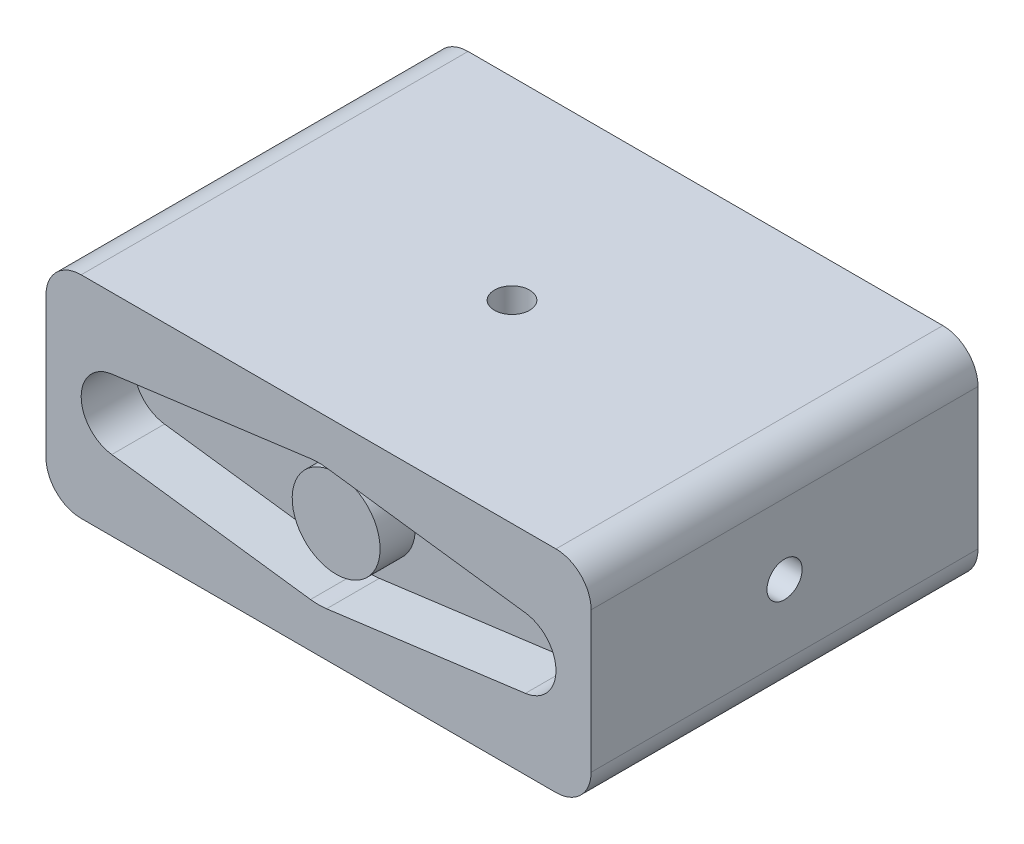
ISO-10303-21;
HEADER;
FILE_DESCRIPTION(('STEP AP214'),'2;1');
FILE_NAME('part.step','',(''),(''),'','','');
FILE_SCHEMA(('AUTOMOTIVE_DESIGN { 1 0 10303 214 1 1 1 1 }'));
ENDSEC;
DATA;
#1=APPLICATION_CONTEXT('core data for automotive mechanical design processes');
#2=APPLICATION_PROTOCOL_DEFINITION('international standard','automotive_design',2000,#1);
#3=PRODUCT_CONTEXT('',#1,'mechanical');
#4=PRODUCT('Part','Part','',(#3));
#5=PRODUCT_RELATED_PRODUCT_CATEGORY('part','',(#4));
#6=PRODUCT_DEFINITION_FORMATION('','',#4);
#7=PRODUCT_DEFINITION_CONTEXT('part definition',#1,'design');
#8=PRODUCT_DEFINITION('design','',#6,#7);
#9=PRODUCT_DEFINITION_SHAPE('','',#8);
#10=(LENGTH_UNIT() NAMED_UNIT(*) SI_UNIT(.MILLI.,.METRE.));
#11=(NAMED_UNIT(*) PLANE_ANGLE_UNIT() SI_UNIT($,.RADIAN.));
#12=(NAMED_UNIT(*) SI_UNIT($,.STERADIAN.) SOLID_ANGLE_UNIT());
#13=UNCERTAINTY_MEASURE_WITH_UNIT(LENGTH_MEASURE(1.E-05),#10,'distance_accuracy_value','');
#14=(GEOMETRIC_REPRESENTATION_CONTEXT(3) GLOBAL_UNCERTAINTY_ASSIGNED_CONTEXT((#13)) GLOBAL_UNIT_ASSIGNED_CONTEXT((#10,
#11,#12)) REPRESENTATION_CONTEXT('',''));
#15=CARTESIAN_POINT('',(0.,0.,0.));
#16=DIRECTION('',(0.,0.,1.));
#17=DIRECTION('',(1.,0.,0.));
#18=AXIS2_PLACEMENT_3D('',#15,#16,#17);
#19=CARTESIAN_POINT('',(0.,0.,0.));
#20=DIRECTION('',(0.,0.,1.));
#21=DIRECTION('',(1.,0.,0.));
#22=AXIS2_PLACEMENT_3D('',#19,#20,#21);
#23=PLANE('',#22);
#24=DIRECTION('',(0.991456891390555,0.130434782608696,0.));
#25=VECTOR('',#24,1.);
#26=CARTESIAN_POINT('',(-5.95652173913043,3.47009911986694,0.));
#27=LINE('',#26,#25);
#28=CARTESIAN_POINT('',(-17.2608695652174,1.98291378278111,0.));
#29=VERTEX_POINT('',#28);
#30=CARTESIAN_POINT('',(-5.95652173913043,3.47009911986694,0.));
#31=VERTEX_POINT('',#30);
#32=EDGE_CURVE('E387',#29,#31,#27,.T.);
#33=ORIENTED_EDGE('',*,*,#32,.T.);
#34=CARTESIAN_POINT('',(-5.5,0.,0.));
#35=DIRECTION('',(0.,0.,1.));
#36=DIRECTION('',(1.,0.,0.));
#37=AXIS2_PLACEMENT_3D('',#34,#35,#36);
#38=CIRCLE('',#37,3.5);
#39=CARTESIAN_POINT('',(-5.04347826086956,3.47009911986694,0.));
#40=VERTEX_POINT('',#39);
#41=EDGE_CURVE('E374',#31,#40,#38,.F.);
#42=ORIENTED_EDGE('',*,*,#41,.T.);
#43=DIRECTION('',(0.991456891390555,-0.130434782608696,0.));
#44=VECTOR('',#43,1.);
#45=CARTESIAN_POINT('',(-5.04347826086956,3.47009911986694,0.));
#46=LINE('',#45,#44);
#47=CARTESIAN_POINT('',(6.26086956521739,1.98291378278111,0.));
#48=VERTEX_POINT('',#47);
#49=EDGE_CURVE('E384',#40,#48,#46,.T.);
#50=ORIENTED_EDGE('',*,*,#49,.T.);
#51=CARTESIAN_POINT('',(6.,0.,0.));
#52=DIRECTION('',(0.,0.,-1.));
#53=DIRECTION('',(0.,1.,0.));
#54=AXIS2_PLACEMENT_3D('',#51,#52,#53);
#55=CIRCLE('',#54,2.);
#56=CARTESIAN_POINT('',(6.26086956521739,-1.98291378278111,0.));
#57=VERTEX_POINT('',#56);
#58=EDGE_CURVE('E509',#48,#57,#55,.T.);
#59=ORIENTED_EDGE('',*,*,#58,.T.);
#60=DIRECTION('',(-0.991456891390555,-0.130434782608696,0.));
#61=VECTOR('',#60,1.);
#62=CARTESIAN_POINT('',(-5.04347826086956,-3.47009911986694,0.));
#63=LINE('',#62,#61);
#64=CARTESIAN_POINT('',(-5.04347826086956,-3.47009911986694,0.));
#65=VERTEX_POINT('',#64);
#66=EDGE_CURVE('E507',#57,#65,#63,.T.);
#67=ORIENTED_EDGE('',*,*,#66,.T.);
#68=CARTESIAN_POINT('',(-5.95652173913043,-3.47009911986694,0.));
#69=VERTEX_POINT('',#68);
#70=EDGE_CURVE('E44',#65,#69,#38,.F.);
#71=ORIENTED_EDGE('',*,*,#70,.T.);
#72=DIRECTION('',(-0.991456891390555,0.130434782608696,0.));
#73=VECTOR('',#72,1.);
#74=CARTESIAN_POINT('',(-5.95652173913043,-3.47009911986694,0.));
#75=LINE('',#74,#73);
#76=CARTESIAN_POINT('',(-17.2608695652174,-1.98291378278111,0.));
#77=VERTEX_POINT('',#76);
#78=EDGE_CURVE('E490',#69,#77,#75,.T.);
#79=ORIENTED_EDGE('',*,*,#78,.T.);
#80=CARTESIAN_POINT('',(-17.,0.,0.));
#81=DIRECTION('',(0.,0.,-1.));
#82=DIRECTION('',(0.,-1.,0.));
#83=AXIS2_PLACEMENT_3D('',#80,#81,#82);
#84=CIRCLE('',#83,2.);
#85=EDGE_CURVE('E492',#77,#29,#84,.T.);
#86=ORIENTED_EDGE('',*,*,#85,.T.);
#87=EDGE_LOOP('',(#33,#42,#50,#59,#67,#71,#79,#86));
#88=FACE_BOUND('',#87,.T.);
#89=DIRECTION('',(0.,1.,0.));
#90=VECTOR('',#89,1.);
#91=CARTESIAN_POINT('',(10.,-6.,0.));
#92=LINE('',#91,#90);
#93=CARTESIAN_POINT('',(10.,-4.,0.));
#94=VERTEX_POINT('',#93);
#95=CARTESIAN_POINT('',(10.,4.,0.));
#96=VERTEX_POINT('',#95);
#97=EDGE_CURVE('E417',#94,#96,#92,.T.);
#98=ORIENTED_EDGE('',*,*,#97,.T.);
#99=CARTESIAN_POINT('',(8.,4.,0.));
#100=DIRECTION('',(0.,0.,1.));
#101=DIRECTION('',(1.,0.,0.));
#102=AXIS2_PLACEMENT_3D('',#99,#100,#101);
#103=CIRCLE('',#102,2.);
#104=CARTESIAN_POINT('',(8.,6.,0.));
#105=VERTEX_POINT('',#104);
#106=EDGE_CURVE('E450',#96,#105,#103,.T.);
#107=ORIENTED_EDGE('',*,*,#106,.T.);
#108=DIRECTION('',(-1.,0.,0.));
#109=VECTOR('',#108,1.);
#110=CARTESIAN_POINT('',(10.,6.,0.));
#111=LINE('',#110,#109);
#112=CARTESIAN_POINT('',(-19.,6.,0.));
#113=VERTEX_POINT('',#112);
#114=EDGE_CURVE('E432',#105,#113,#111,.T.);
#115=ORIENTED_EDGE('',*,*,#114,.T.);
#116=CARTESIAN_POINT('',(-19.,4.,0.));
#117=DIRECTION('',(0.,0.,1.));
#118=DIRECTION('',(1.,0.,0.));
#119=AXIS2_PLACEMENT_3D('',#116,#117,#118);
#120=CIRCLE('',#119,2.);
#121=CARTESIAN_POINT('',(-21.,4.,0.));
#122=VERTEX_POINT('',#121);
#123=EDGE_CURVE('E448',#113,#122,#120,.T.);
#124=ORIENTED_EDGE('',*,*,#123,.T.);
#125=DIRECTION('',(0.,-1.,0.));
#126=VECTOR('',#125,1.);
#127=CARTESIAN_POINT('',(-21.,-6.,0.));
#128=LINE('',#127,#126);
#129=CARTESIAN_POINT('',(-21.,-4.,0.));
#130=VERTEX_POINT('',#129);
#131=EDGE_CURVE('E435',#122,#130,#128,.T.);
#132=ORIENTED_EDGE('',*,*,#131,.T.);
#133=CARTESIAN_POINT('',(-19.,-4.,0.));
#134=DIRECTION('',(0.,0.,1.));
#135=DIRECTION('',(1.,0.,0.));
#136=AXIS2_PLACEMENT_3D('',#133,#134,#135);
#137=CIRCLE('',#136,2.);
#138=CARTESIAN_POINT('',(-19.,-6.,0.));
#139=VERTEX_POINT('',#138);
#140=EDGE_CURVE('E444',#130,#139,#137,.T.);
#141=ORIENTED_EDGE('',*,*,#140,.T.);
#142=DIRECTION('',(1.,0.,0.));
#143=VECTOR('',#142,1.);
#144=CARTESIAN_POINT('',(10.,-6.,0.));
#145=LINE('',#144,#143);
#146=CARTESIAN_POINT('',(8.,-6.,0.));
#147=VERTEX_POINT('',#146);
#148=EDGE_CURVE('E422',#139,#147,#145,.T.);
#149=ORIENTED_EDGE('',*,*,#148,.T.);
#150=CARTESIAN_POINT('',(8.,-4.,0.));
#151=DIRECTION('',(0.,0.,1.));
#152=DIRECTION('',(1.,0.,0.));
#153=AXIS2_PLACEMENT_3D('',#150,#151,#152);
#154=CIRCLE('',#153,2.);
#155=EDGE_CURVE('E446',#147,#94,#154,.T.);
#156=ORIENTED_EDGE('',*,*,#155,.T.);
#157=EDGE_LOOP('',(#98,#107,#115,#124,#132,#141,#149,#156));
#158=FACE_BOUND('',#157,.T.);
#159=ADVANCED_FACE('F35',(#88,#158),#23,.T.);
#160=CARTESIAN_POINT('',(10.,-6.,-22.));
#161=DIRECTION('',(1.,0.,0.));
#162=DIRECTION('',(0.,0.,-1.));
#163=AXIS2_PLACEMENT_3D('',#160,#161,#162);
#164=PLANE('',#163);
#165=CARTESIAN_POINT('',(10.,0.,-11.));
#166=DIRECTION('',(1.,0.,0.));
#167=DIRECTION('',(0.,0.,-1.));
#168=AXIS2_PLACEMENT_3D('',#165,#166,#167);
#169=CIRCLE('',#168,1.);
#170=CARTESIAN_POINT('',(10.,0.,-12.));
#171=VERTEX_POINT('',#170);
#172=EDGE_CURVE('E809',#171,#171,#169,.F.);
#173=ORIENTED_EDGE('',*,*,#172,.T.);
#174=EDGE_LOOP('',(#173));
#175=FACE_BOUND('',#174,.T.);
#176=DIRECTION('',(0.,1.,0.));
#177=VECTOR('',#176,1.);
#178=CARTESIAN_POINT('',(10.,-6.,-22.));
#179=LINE('',#178,#177);
#180=CARTESIAN_POINT('',(10.,-4.,-22.));
#181=VERTEX_POINT('',#180);
#182=CARTESIAN_POINT('',(10.,4.,-22.));
#183=VERTEX_POINT('',#182);
#184=EDGE_CURVE('E418',#181,#183,#179,.T.);
#185=ORIENTED_EDGE('',*,*,#184,.T.);
#186=DIRECTION('',(0.,0.,1.));
#187=VECTOR('',#186,1.);
#188=CARTESIAN_POINT('',(10.,4.,-22.));
#189=LINE('',#188,#187);
#190=EDGE_CURVE('E441',#183,#96,#189,.T.);
#191=ORIENTED_EDGE('',*,*,#190,.T.);
#192=ORIENTED_EDGE('',*,*,#97,.F.);
#193=DIRECTION('',(0.,0.,1.));
#194=VECTOR('',#193,1.);
#195=CARTESIAN_POINT('',(10.,-4.,-22.));
#196=LINE('',#195,#194);
#197=EDGE_CURVE('E349',#94,#181,#196,.F.);
#198=ORIENTED_EDGE('',*,*,#197,.T.);
#199=EDGE_LOOP('',(#185,#191,#192,#198));
#200=FACE_BOUND('',#199,.T.);
#201=ADVANCED_FACE('F316',(#175,#200),#164,.T.);
#202=CARTESIAN_POINT('',(10.,-6.,-22.));
#203=DIRECTION('',(0.,-1.,0.));
#204=DIRECTION('',(1.,0.,0.));
#205=AXIS2_PLACEMENT_3D('',#202,#203,#204);
#206=PLANE('',#205);
#207=DIRECTION('',(1.,0.,0.));
#208=VECTOR('',#207,1.);
#209=CARTESIAN_POINT('',(10.,-6.,-22.));
#210=LINE('',#209,#208);
#211=CARTESIAN_POINT('',(-19.,-6.,-22.));
#212=VERTEX_POINT('',#211);
#213=CARTESIAN_POINT('',(8.,-6.,-22.));
#214=VERTEX_POINT('',#213);
#215=EDGE_CURVE('E428',#212,#214,#210,.T.);
#216=ORIENTED_EDGE('',*,*,#215,.T.);
#217=DIRECTION('',(0.,0.,1.));
#218=VECTOR('',#217,1.);
#219=CARTESIAN_POINT('',(8.,-6.,-22.));
#220=LINE('',#219,#218);
#221=EDGE_CURVE('E351',#214,#147,#220,.T.);
#222=ORIENTED_EDGE('',*,*,#221,.T.);
#223=ORIENTED_EDGE('',*,*,#148,.F.);
#224=DIRECTION('',(0.,0.,1.));
#225=VECTOR('',#224,1.);
#226=CARTESIAN_POINT('',(-19.,-6.,-22.));
#227=LINE('',#226,#225);
#228=EDGE_CURVE('E371',#139,#212,#227,.F.);
#229=ORIENTED_EDGE('',*,*,#228,.T.);
#230=EDGE_LOOP('',(#216,#222,#223,#229));
#231=FACE_BOUND('',#230,.T.);
#232=ADVANCED_FACE('F318',(#231),#206,.T.);
#233=CARTESIAN_POINT('',(-21.,-6.,-22.));
#234=DIRECTION('',(-1.,0.,0.));
#235=DIRECTION('',(0.,0.,1.));
#236=AXIS2_PLACEMENT_3D('',#233,#234,#235);
#237=PLANE('',#236);
#238=CARTESIAN_POINT('',(-21.,0.,-11.));
#239=DIRECTION('',(-1.,0.,0.));
#240=DIRECTION('',(0.,0.,1.));
#241=AXIS2_PLACEMENT_3D('',#238,#239,#240);
#242=CIRCLE('',#241,1.);
#243=CARTESIAN_POINT('',(-21.,0.,-10.));
#244=VERTEX_POINT('',#243);
#245=EDGE_CURVE('E801',#244,#244,#242,.T.);
#246=ORIENTED_EDGE('',*,*,#245,.F.);
#247=EDGE_LOOP('',(#246));
#248=FACE_BOUND('',#247,.T.);
#249=ORIENTED_EDGE('',*,*,#131,.F.);
#250=DIRECTION('',(0.,0.,1.));
#251=VECTOR('',#250,1.);
#252=CARTESIAN_POINT('',(-21.,4.,-22.));
#253=LINE('',#252,#251);
#254=CARTESIAN_POINT('',(-21.,4.,-22.));
#255=VERTEX_POINT('',#254);
#256=EDGE_CURVE('E369',#122,#255,#253,.F.);
#257=ORIENTED_EDGE('',*,*,#256,.T.);
#258=DIRECTION('',(0.,-1.,0.));
#259=VECTOR('',#258,1.);
#260=CARTESIAN_POINT('',(-21.,-6.,-22.));
#261=LINE('',#260,#259);
#262=CARTESIAN_POINT('',(-21.,-4.,-22.));
#263=VERTEX_POINT('',#262);
#264=EDGE_CURVE('E425',#255,#263,#261,.T.);
#265=ORIENTED_EDGE('',*,*,#264,.T.);
#266=DIRECTION('',(0.,0.,1.));
#267=VECTOR('',#266,1.);
#268=CARTESIAN_POINT('',(-21.,-4.,-22.));
#269=LINE('',#268,#267);
#270=EDGE_CURVE('E366',#263,#130,#269,.T.);
#271=ORIENTED_EDGE('',*,*,#270,.T.);
#272=EDGE_LOOP('',(#249,#257,#265,#271));
#273=FACE_BOUND('',#272,.T.);
#274=ADVANCED_FACE('F321',(#248,#273),#237,.T.);
#275=CARTESIAN_POINT('',(10.,6.,-22.));
#276=DIRECTION('',(0.,1.,0.));
#277=DIRECTION('',(-1.,0.,0.));
#278=AXIS2_PLACEMENT_3D('',#275,#276,#277);
#279=PLANE('',#278);
#280=CARTESIAN_POINT('',(-5.5,6.,-11.));
#281=DIRECTION('',(0.,1.,0.));
#282=DIRECTION('',(-1.,0.,0.));
#283=AXIS2_PLACEMENT_3D('',#280,#281,#282);
#284=CIRCLE('',#283,1.);
#285=CARTESIAN_POINT('',(-6.5,6.,-11.));
#286=VERTEX_POINT('',#285);
#287=EDGE_CURVE('E805',#286,#286,#284,.T.);
#288=ORIENTED_EDGE('',*,*,#287,.F.);
#289=EDGE_LOOP('',(#288));
#290=FACE_BOUND('',#289,.T.);
#291=ORIENTED_EDGE('',*,*,#114,.F.);
#292=DIRECTION('',(0.,0.,1.));
#293=VECTOR('',#292,1.);
#294=CARTESIAN_POINT('',(8.,6.,-22.));
#295=LINE('',#294,#293);
#296=CARTESIAN_POINT('',(8.,6.,-22.));
#297=VERTEX_POINT('',#296);
#298=EDGE_CURVE('E361',#105,#297,#295,.F.);
#299=ORIENTED_EDGE('',*,*,#298,.T.);
#300=DIRECTION('',(-1.,0.,0.));
#301=VECTOR('',#300,1.);
#302=CARTESIAN_POINT('',(10.,6.,-22.));
#303=LINE('',#302,#301);
#304=CARTESIAN_POINT('',(-19.,6.,-22.));
#305=VERTEX_POINT('',#304);
#306=EDGE_CURVE('E421',#297,#305,#303,.T.);
#307=ORIENTED_EDGE('',*,*,#306,.T.);
#308=DIRECTION('',(0.,0.,1.));
#309=VECTOR('',#308,1.);
#310=CARTESIAN_POINT('',(-19.,6.,-22.));
#311=LINE('',#310,#309);
#312=EDGE_CURVE('E452',#305,#113,#311,.T.);
#313=ORIENTED_EDGE('',*,*,#312,.T.);
#314=EDGE_LOOP('',(#291,#299,#307,#313));
#315=FACE_BOUND('',#314,.T.);
#316=ADVANCED_FACE('F312',(#290,#315),#279,.T.);
#317=CARTESIAN_POINT('',(0.,0.,-22.));
#318=DIRECTION('',(0.,0.,1.));
#319=DIRECTION('',(1.,0.,0.));
#320=AXIS2_PLACEMENT_3D('',#317,#318,#319);
#321=PLANE('',#320);
#322=DIRECTION('',(1.,0.,0.));
#323=VECTOR('',#322,1.);
#324=CARTESIAN_POINT('',(-17.,4.00000000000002,-22.));
#325=LINE('',#324,#323);
#326=CARTESIAN_POINT('',(-17.,4.00000000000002,-22.));
#327=VERTEX_POINT('',#326);
#328=CARTESIAN_POINT('',(6.00000000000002,4.00000000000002,-22.));
#329=VERTEX_POINT('',#328);
#330=EDGE_CURVE('E228',#327,#329,#325,.T.);
#331=ORIENTED_EDGE('',*,*,#330,.F.);
#332=DIRECTION('',(0.,1.,0.));
#333=VECTOR('',#332,1.);
#334=CARTESIAN_POINT('',(-17.,4.00000000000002,-22.));
#335=LINE('',#334,#333);
#336=CARTESIAN_POINT('',(-17.,-3.99999999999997,-22.));
#337=VERTEX_POINT('',#336);
#338=EDGE_CURVE('E51',#337,#327,#335,.T.);
#339=ORIENTED_EDGE('',*,*,#338,.F.);
#340=DIRECTION('',(-1.,0.,0.));
#341=VECTOR('',#340,1.);
#342=CARTESIAN_POINT('',(-17.,-3.99999999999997,-22.));
#343=LINE('',#342,#341);
#344=CARTESIAN_POINT('',(6.00000000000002,-3.99999999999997,-22.));
#345=VERTEX_POINT('',#344);
#346=EDGE_CURVE('E216',#345,#337,#343,.T.);
#347=ORIENTED_EDGE('',*,*,#346,.F.);
#348=DIRECTION('',(0.,-1.,0.));
#349=VECTOR('',#348,1.);
#350=CARTESIAN_POINT('',(6.00000000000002,4.00000000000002,-22.));
#351=LINE('',#350,#349);
#352=EDGE_CURVE('E219',#329,#345,#351,.T.);
#353=ORIENTED_EDGE('',*,*,#352,.F.);
#354=EDGE_LOOP('',(#331,#339,#347,#353));
#355=FACE_BOUND('',#354,.T.);
#356=ORIENTED_EDGE('',*,*,#306,.F.);
#357=CARTESIAN_POINT('',(8.,4.,-22.));
#358=DIRECTION('',(0.,0.,1.));
#359=DIRECTION('',(1.,0.,0.));
#360=AXIS2_PLACEMENT_3D('',#357,#358,#359);
#361=CIRCLE('',#360,2.);
#362=EDGE_CURVE('E359',#297,#183,#361,.F.);
#363=ORIENTED_EDGE('',*,*,#362,.T.);
#364=ORIENTED_EDGE('',*,*,#184,.F.);
#365=CARTESIAN_POINT('',(8.,-4.,-22.));
#366=DIRECTION('',(0.,0.,1.));
#367=DIRECTION('',(1.,0.,0.));
#368=AXIS2_PLACEMENT_3D('',#365,#366,#367);
#369=CIRCLE('',#368,2.);
#370=EDGE_CURVE('E348',#181,#214,#369,.F.);
#371=ORIENTED_EDGE('',*,*,#370,.T.);
#372=ORIENTED_EDGE('',*,*,#215,.F.);
#373=CARTESIAN_POINT('',(-19.,-4.,-22.));
#374=DIRECTION('',(0.,0.,1.));
#375=DIRECTION('',(1.,0.,0.));
#376=AXIS2_PLACEMENT_3D('',#373,#374,#375);
#377=CIRCLE('',#376,2.);
#378=EDGE_CURVE('E357',#212,#263,#377,.F.);
#379=ORIENTED_EDGE('',*,*,#378,.T.);
#380=ORIENTED_EDGE('',*,*,#264,.F.);
#381=CARTESIAN_POINT('',(-19.,4.,-22.));
#382=DIRECTION('',(0.,0.,1.));
#383=DIRECTION('',(1.,0.,0.));
#384=AXIS2_PLACEMENT_3D('',#381,#382,#383);
#385=CIRCLE('',#384,2.);
#386=EDGE_CURVE('E356',#255,#305,#385,.F.);
#387=ORIENTED_EDGE('',*,*,#386,.T.);
#388=EDGE_LOOP('',(#356,#363,#364,#371,#372,#379,#380,#387));
#389=FACE_BOUND('',#388,.T.);
#390=ADVANCED_FACE('F308',(#355,#389),#321,.F.);
#391=CARTESIAN_POINT('',(8.,4.,-22.));
#392=DIRECTION('',(0.,0.,1.));
#393=DIRECTION('',(1.,0.,0.));
#394=AXIS2_PLACEMENT_3D('',#391,#392,#393);
#395=CYLINDRICAL_SURFACE('',#394,2.);
#396=ORIENTED_EDGE('',*,*,#362,.F.);
#397=ORIENTED_EDGE('',*,*,#298,.F.);
#398=ORIENTED_EDGE('',*,*,#106,.F.);
#399=ORIENTED_EDGE('',*,*,#190,.F.);
#400=EDGE_LOOP('',(#396,#397,#398,#399));
#401=FACE_BOUND('',#400,.T.);
#402=ADVANCED_FACE('F311',(#401),#395,.T.);
#403=CARTESIAN_POINT('',(-19.,4.,-22.));
#404=DIRECTION('',(0.,0.,1.));
#405=DIRECTION('',(1.,0.,0.));
#406=AXIS2_PLACEMENT_3D('',#403,#404,#405);
#407=CYLINDRICAL_SURFACE('',#406,2.);
#408=ORIENTED_EDGE('',*,*,#386,.F.);
#409=ORIENTED_EDGE('',*,*,#256,.F.);
#410=ORIENTED_EDGE('',*,*,#123,.F.);
#411=ORIENTED_EDGE('',*,*,#312,.F.);
#412=EDGE_LOOP('',(#408,#409,#410,#411));
#413=FACE_BOUND('',#412,.T.);
#414=ADVANCED_FACE('F334',(#413),#407,.T.);
#415=CARTESIAN_POINT('',(8.,-4.,-22.));
#416=DIRECTION('',(0.,0.,1.));
#417=DIRECTION('',(1.,0.,0.));
#418=AXIS2_PLACEMENT_3D('',#415,#416,#417);
#419=CYLINDRICAL_SURFACE('',#418,2.);
#420=ORIENTED_EDGE('',*,*,#370,.F.);
#421=ORIENTED_EDGE('',*,*,#197,.F.);
#422=ORIENTED_EDGE('',*,*,#155,.F.);
#423=ORIENTED_EDGE('',*,*,#221,.F.);
#424=EDGE_LOOP('',(#420,#421,#422,#423));
#425=FACE_BOUND('',#424,.T.);
#426=ADVANCED_FACE('F337',(#425),#419,.T.);
#427=CARTESIAN_POINT('',(-19.,-4.,-22.));
#428=DIRECTION('',(0.,0.,1.));
#429=DIRECTION('',(1.,0.,0.));
#430=AXIS2_PLACEMENT_3D('',#427,#428,#429);
#431=CYLINDRICAL_SURFACE('',#430,2.);
#432=ORIENTED_EDGE('',*,*,#378,.F.);
#433=ORIENTED_EDGE('',*,*,#228,.F.);
#434=ORIENTED_EDGE('',*,*,#140,.F.);
#435=ORIENTED_EDGE('',*,*,#270,.F.);
#436=EDGE_LOOP('',(#432,#433,#434,#435));
#437=FACE_BOUND('',#436,.T.);
#438=ADVANCED_FACE('F37',(#437),#431,.T.);
#439=CARTESIAN_POINT('',(-5.5,0.,-3.00000000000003));
#440=DIRECTION('',(0.,0.,1.));
#441=DIRECTION('',(0.,1.,0.));
#442=AXIS2_PLACEMENT_3D('',#439,#440,#441);
#443=CYLINDRICAL_SURFACE('',#442,3.5);
#444=DIRECTION('',(0.,0.,-1.));
#445=VECTOR('',#444,1.);
#446=CARTESIAN_POINT('',(-5.04347826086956,-3.47009911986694,0.));
#447=LINE('',#446,#445);
#448=CARTESIAN_POINT('',(-5.04347826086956,-3.47009911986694,-3.00000000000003));
#449=VERTEX_POINT('',#448);
#450=EDGE_CURVE('E482',#65,#449,#447,.T.);
#451=ORIENTED_EDGE('',*,*,#450,.T.);
#452=CARTESIAN_POINT('',(-5.5,0.,-3.00000000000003));
#453=DIRECTION('',(0.,0.,-1.));
#454=DIRECTION('',(0.,-1.,0.));
#455=AXIS2_PLACEMENT_3D('',#452,#453,#454);
#456=CIRCLE('',#455,3.5);
#457=CARTESIAN_POINT('',(-5.95652173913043,-3.47009911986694,-3.00000000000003));
#458=VERTEX_POINT('',#457);
#459=EDGE_CURVE('E401',#449,#458,#456,.T.);
#460=ORIENTED_EDGE('',*,*,#459,.T.);
#461=DIRECTION('',(0.,0.,-1.));
#462=VECTOR('',#461,1.);
#463=CARTESIAN_POINT('',(-5.95652173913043,-3.47009911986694,0.));
#464=LINE('',#463,#462);
#465=EDGE_CURVE('E409',#69,#458,#464,.T.);
#466=ORIENTED_EDGE('',*,*,#465,.F.);
#467=ORIENTED_EDGE('',*,*,#70,.F.);
#468=EDGE_LOOP('',(#451,#460,#466,#467));
#469=FACE_BOUND('',#468,.T.);
#470=ADVANCED_FACE('F300',(#469),#443,.F.);
#471=CARTESIAN_POINT('',(-5.5,0.,-3.00000000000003));
#472=DIRECTION('',(0.,0.,-1.));
#473=DIRECTION('',(0.,-1.,0.));
#474=AXIS2_PLACEMENT_3D('',#471,#472,#473);
#475=PLANE('',#474);
#476=CARTESIAN_POINT('',(-5.95652173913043,3.47009911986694,-3.00000000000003));
#477=VERTEX_POINT('',#476);
#478=CARTESIAN_POINT('',(-5.04347826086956,3.47009911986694,-3.00000000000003));
#479=VERTEX_POINT('',#478);
#480=EDGE_CURVE('E412',#477,#479,#456,.T.);
#481=ORIENTED_EDGE('',*,*,#480,.F.);
#482=DIRECTION('',(0.991456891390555,0.130434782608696,0.));
#483=VECTOR('',#482,1.);
#484=CARTESIAN_POINT('',(-5.95652173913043,3.47009911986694,-3.00000000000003));
#485=LINE('',#484,#483);
#486=CARTESIAN_POINT('',(-17.2608695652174,1.98291378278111,-3.00000000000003));
#487=VERTEX_POINT('',#486);
#488=EDGE_CURVE('E396',#487,#477,#485,.T.);
#489=ORIENTED_EDGE('',*,*,#488,.F.);
#490=CARTESIAN_POINT('',(-17.,0.,-3.00000000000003));
#491=DIRECTION('',(0.,0.,-1.));
#492=DIRECTION('',(0.,-1.,0.));
#493=AXIS2_PLACEMENT_3D('',#490,#491,#492);
#494=CIRCLE('',#493,2.);
#495=CARTESIAN_POINT('',(-17.2608695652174,-1.98291378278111,-3.00000000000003));
#496=VERTEX_POINT('',#495);
#497=EDGE_CURVE('E488',#496,#487,#494,.T.);
#498=ORIENTED_EDGE('',*,*,#497,.F.);
#499=DIRECTION('',(-0.991456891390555,0.130434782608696,0.));
#500=VECTOR('',#499,1.);
#501=CARTESIAN_POINT('',(-5.95652173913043,-3.47009911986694,-3.00000000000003));
#502=LINE('',#501,#500);
#503=EDGE_CURVE('E486',#458,#496,#502,.T.);
#504=ORIENTED_EDGE('',*,*,#503,.F.);
#505=ORIENTED_EDGE('',*,*,#459,.F.);
#506=DIRECTION('',(-0.991456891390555,-0.130434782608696,0.));
#507=VECTOR('',#506,1.);
#508=CARTESIAN_POINT('',(-5.04347826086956,-3.47009911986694,-3.00000000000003));
#509=LINE('',#508,#507);
#510=CARTESIAN_POINT('',(6.26086956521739,-1.98291378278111,-3.00000000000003));
#511=VERTEX_POINT('',#510);
#512=EDGE_CURVE('E516',#511,#449,#509,.T.);
#513=ORIENTED_EDGE('',*,*,#512,.F.);
#514=CARTESIAN_POINT('',(6.,0.,-3.00000000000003));
#515=DIRECTION('',(0.,0.,-1.));
#516=DIRECTION('',(0.,1.,0.));
#517=AXIS2_PLACEMENT_3D('',#514,#515,#516);
#518=CIRCLE('',#517,2.);
#519=CARTESIAN_POINT('',(6.26086956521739,1.98291378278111,-3.00000000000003));
#520=VERTEX_POINT('',#519);
#521=EDGE_CURVE('E502',#520,#511,#518,.T.);
#522=ORIENTED_EDGE('',*,*,#521,.F.);
#523=DIRECTION('',(0.991456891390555,-0.130434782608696,0.));
#524=VECTOR('',#523,1.);
#525=CARTESIAN_POINT('',(-5.04347826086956,3.47009911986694,-3.00000000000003));
#526=LINE('',#525,#524);
#527=EDGE_CURVE('E500',#479,#520,#526,.T.);
#528=ORIENTED_EDGE('',*,*,#527,.F.);
#529=EDGE_LOOP('',(#481,#489,#498,#504,#505,#513,#522,#528));
#530=FACE_BOUND('',#529,.T.);
#531=CARTESIAN_POINT('',(-5.5,0.,-3.00000000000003));
#532=DIRECTION('',(0.,0.,-1.));
#533=DIRECTION('',(0.,-1.,0.));
#534=AXIS2_PLACEMENT_3D('',#531,#532,#533);
#535=CIRCLE('',#534,2.5);
#536=CARTESIAN_POINT('',(-5.5,-2.5,-3.00000000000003));
#537=VERTEX_POINT('',#536);
#538=EDGE_CURVE('E397',#537,#537,#535,.T.);
#539=ORIENTED_EDGE('',*,*,#538,.T.);
#540=EDGE_LOOP('',(#539));
#541=FACE_BOUND('',#540,.T.);
#542=ADVANCED_FACE('F297',(#530,#541),#475,.F.);
#543=DIRECTION('',(0.,0.,-1.));
#544=VECTOR('',#543,1.);
#545=CARTESIAN_POINT('',(-5.95652173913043,3.47009911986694,0.));
#546=LINE('',#545,#544);
#547=EDGE_CURVE('E391',#31,#477,#546,.T.);
#548=ORIENTED_EDGE('',*,*,#547,.T.);
#549=ORIENTED_EDGE('',*,*,#480,.T.);
#550=DIRECTION('',(0.,0.,-1.));
#551=VECTOR('',#550,1.);
#552=CARTESIAN_POINT('',(-5.04347826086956,3.47009911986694,0.));
#553=LINE('',#552,#551);
#554=EDGE_CURVE('E394',#40,#479,#553,.T.);
#555=ORIENTED_EDGE('',*,*,#554,.F.);
#556=ORIENTED_EDGE('',*,*,#41,.F.);
#557=EDGE_LOOP('',(#548,#549,#555,#556));
#558=FACE_BOUND('',#557,.T.);
#559=ADVANCED_FACE('F295',(#558),#443,.F.);
#560=CARTESIAN_POINT('',(-5.5,0.,-3.00000000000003));
#561=DIRECTION('',(0.,0.,1.));
#562=DIRECTION('',(0.,1.,0.));
#563=AXIS2_PLACEMENT_3D('',#560,#561,#562);
#564=CYLINDRICAL_SURFACE('',#563,2.5);
#565=CARTESIAN_POINT('',(-5.5,0.,-1.00000000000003));
#566=DIRECTION('',(0.,0.,-1.));
#567=DIRECTION('',(0.,-1.,0.));
#568=AXIS2_PLACEMENT_3D('',#565,#566,#567);
#569=CIRCLE('',#568,2.5);
#570=CARTESIAN_POINT('',(-5.5,-2.5,-1.00000000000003));
#571=VERTEX_POINT('',#570);
#572=EDGE_CURVE('E414',#571,#571,#569,.F.);
#573=ORIENTED_EDGE('',*,*,#572,.F.);
#574=EDGE_LOOP('',(#573));
#575=FACE_BOUND('',#574,.T.);
#576=ORIENTED_EDGE('',*,*,#538,.F.);
#577=EDGE_LOOP('',(#576));
#578=FACE_BOUND('',#577,.T.);
#579=ADVANCED_FACE('F292',(#575,#578),#564,.T.);
#580=CARTESIAN_POINT('',(-5.5,0.,-1.00000000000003));
#581=DIRECTION('',(0.,0.,-1.));
#582=DIRECTION('',(0.,-1.,0.));
#583=AXIS2_PLACEMENT_3D('',#580,#581,#582);
#584=PLANE('',#583);
#585=ORIENTED_EDGE('',*,*,#572,.T.);
#586=EDGE_LOOP('',(#585));
#587=FACE_BOUND('',#586,.T.);
#588=ADVANCED_FACE('F284',(#587),#584,.F.);
#589=CARTESIAN_POINT('',(-5.95652173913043,3.47009911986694,0.));
#590=DIRECTION('',(-0.130434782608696,0.991456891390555,0.));
#591=DIRECTION('',(0.991456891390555,0.130434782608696,0.));
#592=AXIS2_PLACEMENT_3D('',#589,#590,#591);
#593=PLANE('',#592);
#594=ORIENTED_EDGE('',*,*,#488,.T.);
#595=ORIENTED_EDGE('',*,*,#547,.F.);
#596=ORIENTED_EDGE('',*,*,#32,.F.);
#597=DIRECTION('',(0.,0.,-1.));
#598=VECTOR('',#597,1.);
#599=CARTESIAN_POINT('',(-17.2608695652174,1.98291378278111,0.));
#600=LINE('',#599,#598);
#601=EDGE_CURVE('E398',#29,#487,#600,.T.);
#602=ORIENTED_EDGE('',*,*,#601,.T.);
#603=EDGE_LOOP('',(#594,#595,#596,#602));
#604=FACE_BOUND('',#603,.T.);
#605=ADVANCED_FACE('F280',(#604),#593,.F.);
#606=CARTESIAN_POINT('',(-17.,0.,0.));
#607=DIRECTION('',(0.,0.,-1.));
#608=DIRECTION('',(0.,-1.,0.));
#609=AXIS2_PLACEMENT_3D('',#606,#607,#608);
#610=CYLINDRICAL_SURFACE('',#609,2.);
#611=ORIENTED_EDGE('',*,*,#497,.T.);
#612=ORIENTED_EDGE('',*,*,#601,.F.);
#613=ORIENTED_EDGE('',*,*,#85,.F.);
#614=DIRECTION('',(0.,0.,-1.));
#615=VECTOR('',#614,1.);
#616=CARTESIAN_POINT('',(-17.2608695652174,-1.98291378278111,0.));
#617=LINE('',#616,#615);
#618=EDGE_CURVE('E403',#77,#496,#617,.T.);
#619=ORIENTED_EDGE('',*,*,#618,.T.);
#620=EDGE_LOOP('',(#611,#612,#613,#619));
#621=FACE_BOUND('',#620,.T.);
#622=ADVANCED_FACE('F283',(#621),#610,.F.);
#623=CARTESIAN_POINT('',(-5.95652173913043,-3.47009911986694,0.));
#624=DIRECTION('',(-0.130434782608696,-0.991456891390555,0.));
#625=DIRECTION('',(-0.991456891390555,0.130434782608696,0.));
#626=AXIS2_PLACEMENT_3D('',#623,#624,#625);
#627=PLANE('',#626);
#628=ORIENTED_EDGE('',*,*,#503,.T.);
#629=ORIENTED_EDGE('',*,*,#618,.F.);
#630=ORIENTED_EDGE('',*,*,#78,.F.);
#631=ORIENTED_EDGE('',*,*,#465,.T.);
#632=EDGE_LOOP('',(#628,#629,#630,#631));
#633=FACE_BOUND('',#632,.T.);
#634=ADVANCED_FACE('F271',(#633),#627,.F.);
#635=CARTESIAN_POINT('',(-5.04347826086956,-3.47009911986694,0.));
#636=DIRECTION('',(0.130434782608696,-0.991456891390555,0.));
#637=DIRECTION('',(-0.991456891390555,-0.130434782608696,0.));
#638=AXIS2_PLACEMENT_3D('',#635,#636,#637);
#639=PLANE('',#638);
#640=ORIENTED_EDGE('',*,*,#512,.T.);
#641=ORIENTED_EDGE('',*,*,#450,.F.);
#642=ORIENTED_EDGE('',*,*,#66,.F.);
#643=DIRECTION('',(0.,0.,-1.));
#644=VECTOR('',#643,1.);
#645=CARTESIAN_POINT('',(6.26086956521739,-1.98291378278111,0.));
#646=LINE('',#645,#644);
#647=EDGE_CURVE('E508',#57,#511,#646,.T.);
#648=ORIENTED_EDGE('',*,*,#647,.T.);
#649=EDGE_LOOP('',(#640,#641,#642,#648));
#650=FACE_BOUND('',#649,.T.);
#651=ADVANCED_FACE('F267',(#650),#639,.F.);
#652=CARTESIAN_POINT('',(6.,0.,0.));
#653=DIRECTION('',(0.,0.,-1.));
#654=DIRECTION('',(0.,-1.,0.));
#655=AXIS2_PLACEMENT_3D('',#652,#653,#654);
#656=CYLINDRICAL_SURFACE('',#655,2.);
#657=ORIENTED_EDGE('',*,*,#521,.T.);
#658=ORIENTED_EDGE('',*,*,#647,.F.);
#659=ORIENTED_EDGE('',*,*,#58,.F.);
#660=DIRECTION('',(0.,0.,-1.));
#661=VECTOR('',#660,1.);
#662=CARTESIAN_POINT('',(6.26086956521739,1.98291378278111,0.));
#663=LINE('',#662,#661);
#664=EDGE_CURVE('E506',#48,#520,#663,.T.);
#665=ORIENTED_EDGE('',*,*,#664,.T.);
#666=EDGE_LOOP('',(#657,#658,#659,#665));
#667=FACE_BOUND('',#666,.T.);
#668=ADVANCED_FACE('F270',(#667),#656,.F.);
#669=CARTESIAN_POINT('',(-5.04347826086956,3.47009911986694,0.));
#670=DIRECTION('',(0.130434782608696,0.991456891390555,0.));
#671=DIRECTION('',(0.991456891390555,-0.130434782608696,0.));
#672=AXIS2_PLACEMENT_3D('',#669,#670,#671);
#673=PLANE('',#672);
#674=ORIENTED_EDGE('',*,*,#527,.T.);
#675=ORIENTED_EDGE('',*,*,#664,.F.);
#676=ORIENTED_EDGE('',*,*,#49,.F.);
#677=ORIENTED_EDGE('',*,*,#554,.T.);
#678=EDGE_LOOP('',(#674,#675,#676,#677));
#679=FACE_BOUND('',#678,.T.);
#680=ADVANCED_FACE('F275',(#679),#673,.F.);
#681=CARTESIAN_POINT('',(-17.,4.00000000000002,-7.));
#682=DIRECTION('',(-1.,0.,0.));
#683=DIRECTION('',(0.,0.,1.));
#684=AXIS2_PLACEMENT_3D('',#681,#682,#683);
#685=PLANE('',#684);
#686=CARTESIAN_POINT('',(-17.,0.,-11.));
#687=DIRECTION('',(-1.,0.,0.));
#688=DIRECTION('',(0.,0.,1.));
#689=AXIS2_PLACEMENT_3D('',#686,#687,#688);
#690=CIRCLE('',#689,1.);
#691=CARTESIAN_POINT('',(-17.,0.,-10.));
#692=VERTEX_POINT('',#691);
#693=EDGE_CURVE('E804',#692,#692,#690,.T.);
#694=ORIENTED_EDGE('',*,*,#693,.T.);
#695=EDGE_LOOP('',(#694));
#696=FACE_BOUND('',#695,.T.);
#697=ORIENTED_EDGE('',*,*,#338,.T.);
#698=DIRECTION('',(0.,0.,-1.));
#699=VECTOR('',#698,1.);
#700=CARTESIAN_POINT('',(-17.,4.00000000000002,-7.));
#701=LINE('',#700,#699);
#702=CARTESIAN_POINT('',(-17.,4.00000000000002,-7.));
#703=VERTEX_POINT('',#702);
#704=EDGE_CURVE('E194',#703,#327,#701,.T.);
#705=ORIENTED_EDGE('',*,*,#704,.F.);
#706=DIRECTION('',(0.,1.,0.));
#707=VECTOR('',#706,1.);
#708=CARTESIAN_POINT('',(-17.,4.00000000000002,-7.));
#709=LINE('',#708,#707);
#710=CARTESIAN_POINT('',(-17.,-3.99999999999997,-7.));
#711=VERTEX_POINT('',#710);
#712=EDGE_CURVE('E198',#711,#703,#709,.T.);
#713=ORIENTED_EDGE('',*,*,#712,.F.);
#714=DIRECTION('',(0.,0.,-1.));
#715=VECTOR('',#714,1.);
#716=CARTESIAN_POINT('',(-17.,-3.99999999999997,-7.));
#717=LINE('',#716,#715);
#718=EDGE_CURVE('E232',#711,#337,#717,.T.);
#719=ORIENTED_EDGE('',*,*,#718,.T.);
#720=EDGE_LOOP('',(#697,#705,#713,#719));
#721=FACE_BOUND('',#720,.T.);
#722=ADVANCED_FACE('F196',(#696,#721),#685,.F.);
#723=CARTESIAN_POINT('',(-17.,-3.99999999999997,-7.));
#724=DIRECTION('',(0.,-1.,0.));
#725=DIRECTION('',(0.,0.,-1.));
#726=AXIS2_PLACEMENT_3D('',#723,#724,#725);
#727=PLANE('',#726);
#728=ORIENTED_EDGE('',*,*,#346,.T.);
#729=ORIENTED_EDGE('',*,*,#718,.F.);
#730=DIRECTION('',(-1.,0.,0.));
#731=VECTOR('',#730,1.);
#732=CARTESIAN_POINT('',(-17.,-3.99999999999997,-7.));
#733=LINE('',#732,#731);
#734=CARTESIAN_POINT('',(6.00000000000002,-3.99999999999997,-7.));
#735=VERTEX_POINT('',#734);
#736=EDGE_CURVE('E204',#735,#711,#733,.T.);
#737=ORIENTED_EDGE('',*,*,#736,.F.);
#738=DIRECTION('',(0.,0.,-1.));
#739=VECTOR('',#738,1.);
#740=CARTESIAN_POINT('',(6.00000000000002,-3.99999999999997,-7.));
#741=LINE('',#740,#739);
#742=EDGE_CURVE('E235',#735,#345,#741,.T.);
#743=ORIENTED_EDGE('',*,*,#742,.T.);
#744=EDGE_LOOP('',(#728,#729,#737,#743));
#745=FACE_BOUND('',#744,.T.);
#746=ADVANCED_FACE('F569',(#745),#727,.F.);
#747=CARTESIAN_POINT('',(6.00000000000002,4.00000000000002,-7.));
#748=DIRECTION('',(1.,0.,0.));
#749=DIRECTION('',(0.,1.,0.));
#750=AXIS2_PLACEMENT_3D('',#747,#748,#749);
#751=PLANE('',#750);
#752=CARTESIAN_POINT('',(6.00000000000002,0.,-11.));
#753=DIRECTION('',(1.,0.,0.));
#754=DIRECTION('',(0.,1.,0.));
#755=AXIS2_PLACEMENT_3D('',#752,#753,#754);
#756=CIRCLE('',#755,1.);
#757=CARTESIAN_POINT('',(6.00000000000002,0.999999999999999,-11.));
#758=VERTEX_POINT('',#757);
#759=EDGE_CURVE('E39',#758,#758,#756,.T.);
#760=ORIENTED_EDGE('',*,*,#759,.T.);
#761=EDGE_LOOP('',(#760));
#762=FACE_BOUND('',#761,.T.);
#763=ORIENTED_EDGE('',*,*,#352,.T.);
#764=ORIENTED_EDGE('',*,*,#742,.F.);
#765=DIRECTION('',(0.,-1.,0.));
#766=VECTOR('',#765,1.);
#767=CARTESIAN_POINT('',(6.00000000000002,4.00000000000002,-7.));
#768=LINE('',#767,#766);
#769=CARTESIAN_POINT('',(6.00000000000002,4.00000000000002,-7.));
#770=VERTEX_POINT('',#769);
#771=EDGE_CURVE('E212',#770,#735,#768,.T.);
#772=ORIENTED_EDGE('',*,*,#771,.F.);
#773=DIRECTION('',(0.,0.,-1.));
#774=VECTOR('',#773,1.);
#775=CARTESIAN_POINT('',(6.00000000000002,4.00000000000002,-7.));
#776=LINE('',#775,#774);
#777=EDGE_CURVE('E203',#770,#329,#776,.T.);
#778=ORIENTED_EDGE('',*,*,#777,.T.);
#779=EDGE_LOOP('',(#763,#764,#772,#778));
#780=FACE_BOUND('',#779,.T.);
#781=ADVANCED_FACE('F562',(#762,#780),#751,.F.);
#782=CARTESIAN_POINT('',(-17.,4.00000000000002,-7.));
#783=DIRECTION('',(0.,1.,0.));
#784=DIRECTION('',(0.,0.,1.));
#785=AXIS2_PLACEMENT_3D('',#782,#783,#784);
#786=PLANE('',#785);
#787=CARTESIAN_POINT('',(-5.5,4.00000000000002,-11.));
#788=DIRECTION('',(0.,1.,0.));
#789=DIRECTION('',(0.,0.,1.));
#790=AXIS2_PLACEMENT_3D('',#787,#788,#789);
#791=CIRCLE('',#790,1.);
#792=CARTESIAN_POINT('',(-5.5,4.00000000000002,-10.));
#793=VERTEX_POINT('',#792);
#794=EDGE_CURVE('E222',#793,#793,#791,.F.);
#795=ORIENTED_EDGE('',*,*,#794,.F.);
#796=EDGE_LOOP('',(#795));
#797=FACE_BOUND('',#796,.T.);
#798=ORIENTED_EDGE('',*,*,#330,.T.);
#799=ORIENTED_EDGE('',*,*,#777,.F.);
#800=DIRECTION('',(1.,0.,0.));
#801=VECTOR('',#800,1.);
#802=CARTESIAN_POINT('',(-17.,4.00000000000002,-7.));
#803=LINE('',#802,#801);
#804=EDGE_CURVE('E207',#703,#770,#803,.T.);
#805=ORIENTED_EDGE('',*,*,#804,.F.);
#806=ORIENTED_EDGE('',*,*,#704,.T.);
#807=EDGE_LOOP('',(#798,#799,#805,#806));
#808=FACE_BOUND('',#807,.T.);
#809=ADVANCED_FACE('F208',(#797,#808),#786,.F.);
#810=CARTESIAN_POINT('',(0.,0.,-7.));
#811=DIRECTION('',(0.,0.,1.));
#812=DIRECTION('',(1.,0.,0.));
#813=AXIS2_PLACEMENT_3D('',#810,#811,#812);
#814=PLANE('',#813);
#815=DIRECTION('',(0.,-1.,0.));
#816=VECTOR('',#815,1.);
#817=CARTESIAN_POINT('',(4.90894814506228,3.50000000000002,-6.99999999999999));
#818=LINE('',#817,#816);
#819=CARTESIAN_POINT('',(4.90894814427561,-3.49999999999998,-7.));
#820=VERTEX_POINT('',#819);
#821=CARTESIAN_POINT('',(4.90894814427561,3.50000000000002,-7.));
#822=VERTEX_POINT('',#821);
#823=EDGE_CURVE('E240',#820,#822,#818,.F.);
#824=ORIENTED_EDGE('',*,*,#823,.T.);
#825=DIRECTION('',(1.,0.,0.));
#826=VECTOR('',#825,1.);
#827=CARTESIAN_POINT('',(2.63306411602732,3.50000000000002,-7.));
#828=LINE('',#827,#826);
#829=CARTESIAN_POINT('',(-15.9089481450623,3.50000000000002,-7.00000000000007));
#830=VERTEX_POINT('',#829);
#831=EDGE_CURVE('E58',#830,#822,#828,.T.);
#832=ORIENTED_EDGE('',*,*,#831,.F.);
#833=DIRECTION('',(0.,-1.,0.));
#834=VECTOR('',#833,1.);
#835=CARTESIAN_POINT('',(-15.9089481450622,3.50000000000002,-7.));
#836=LINE('',#835,#834);
#837=CARTESIAN_POINT('',(-15.9089481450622,-3.49999999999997,-7.));
#838=VERTEX_POINT('',#837);
#839=EDGE_CURVE('E11',#830,#838,#836,.T.);
#840=ORIENTED_EDGE('',*,*,#839,.T.);
#841=DIRECTION('',(1.,0.,0.));
#842=VECTOR('',#841,1.);
#843=CARTESIAN_POINT('',(2.63306411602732,-3.49999999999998,-7.));
#844=LINE('',#843,#842);
#845=EDGE_CURVE('E234',#838,#820,#844,.T.);
#846=ORIENTED_EDGE('',*,*,#845,.T.);
#847=EDGE_LOOP('',(#824,#832,#840,#846));
#848=FACE_BOUND('',#847,.T.);
#849=ORIENTED_EDGE('',*,*,#712,.T.);
#850=ORIENTED_EDGE('',*,*,#804,.T.);
#851=ORIENTED_EDGE('',*,*,#771,.T.);
#852=ORIENTED_EDGE('',*,*,#736,.T.);
#853=EDGE_LOOP('',(#849,#850,#851,#852));
#854=FACE_BOUND('',#853,.T.);
#855=ADVANCED_FACE('F214',(#848,#854),#814,.F.);
#856=CARTESIAN_POINT('',(-4.49999999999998,3.50000000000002,-5.00000000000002));
#857=DIRECTION('',(0.,0.,-1.));
#858=DIRECTION('',(-1.,0.,0.));
#859=AXIS2_PLACEMENT_3D('',#856,#857,#858);
#860=PLANE('',#859);
#861=DIRECTION('',(1.,0.,0.));
#862=VECTOR('',#861,1.);
#863=CARTESIAN_POINT('',(-4.49999999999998,-3.49999999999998,-5.00000000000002));
#864=LINE('',#863,#862);
#865=CARTESIAN_POINT('',(-6.49999999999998,-3.49999999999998,-5.00000000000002));
#866=VERTEX_POINT('',#865);
#867=CARTESIAN_POINT('',(-4.49999999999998,-3.49999999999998,-5.00000000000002));
#868=VERTEX_POINT('',#867);
#869=EDGE_CURVE('E250',#866,#868,#864,.T.);
#870=ORIENTED_EDGE('',*,*,#869,.F.);
#871=DIRECTION('',(0.,-1.,0.));
#872=VECTOR('',#871,1.);
#873=CARTESIAN_POINT('',(-6.49999999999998,3.50000000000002,-5.00000000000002));
#874=LINE('',#873,#872);
#875=CARTESIAN_POINT('',(-6.49999999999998,3.50000000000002,-5.00000000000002));
#876=VERTEX_POINT('',#875);
#877=EDGE_CURVE('E504',#876,#866,#874,.T.);
#878=ORIENTED_EDGE('',*,*,#877,.F.);
#879=DIRECTION('',(1.,0.,0.));
#880=VECTOR('',#879,1.);
#881=CARTESIAN_POINT('',(-4.49999999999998,3.50000000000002,-5.00000000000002));
#882=LINE('',#881,#880);
#883=CARTESIAN_POINT('',(-4.49999999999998,3.50000000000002,-5.00000000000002));
#884=VERTEX_POINT('',#883);
#885=EDGE_CURVE('E525',#876,#884,#882,.T.);
#886=ORIENTED_EDGE('',*,*,#885,.T.);
#887=DIRECTION('',(0.,-1.,0.));
#888=VECTOR('',#887,1.);
#889=CARTESIAN_POINT('',(-4.49999999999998,3.50000000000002,-5.00000000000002));
#890=LINE('',#889,#888);
#891=EDGE_CURVE('E522',#884,#868,#890,.T.);
#892=ORIENTED_EDGE('',*,*,#891,.T.);
#893=EDGE_LOOP('',(#870,#878,#886,#892));
#894=FACE_BOUND('',#893,.T.);
#895=ADVANCED_FACE('F264',(#894),#860,.T.);
#896=CARTESIAN_POINT('',(-4.49999999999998,3.50000000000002,-5.00000000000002));
#897=CARTESIAN_POINT('',(-0.22950622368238,3.50000000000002,-5.00000000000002));
#898=CARTESIAN_POINT('',(5.24256304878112,3.50000000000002,-4.7041806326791));
#899=CARTESIAN_POINT('',(5.50000000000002,3.50000000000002,-9.10169105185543));
#900=CARTESIAN_POINT('',(5.50000000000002,3.50000000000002,-9.75000000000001));
#901=B_SPLINE_CURVE_WITH_KNOTS('',3,(#896,#897,#898,#899,#900),.UNSPECIFIED.,.F.,.F.,(4,1,4),
(0.,0.838681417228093,1.),.UNSPECIFIED.);
#902=DIRECTION('',(0.,-1.,0.));
#903=VECTOR('',#902,1.);
#904=SURFACE_OF_LINEAR_EXTRUSION('',#901,#903);
#905=ORIENTED_EDGE('',*,*,#823,.F.);
#906=CARTESIAN_POINT('',(-4.49999999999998,-3.49999999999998,-5.00000000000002));
#907=CARTESIAN_POINT('',(-0.229506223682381,-3.49999999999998,-5.00000000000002));
#908=CARTESIAN_POINT('',(5.24256304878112,-3.49999999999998,-4.7041806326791));
#909=CARTESIAN_POINT('',(5.50000000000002,-3.49999999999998,-9.10169105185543));
#910=CARTESIAN_POINT('',(5.50000000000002,-3.49999999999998,-9.75000000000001));
#911=B_SPLINE_CURVE_WITH_KNOTS('',3,(#906,#907,#908,#909,#910),.UNSPECIFIED.,.F.,.F.,(4,1,4),
(0.,0.838681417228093,1.),.UNSPECIFIED.);
#912=EDGE_CURVE('E242',#868,#820,#911,.T.);
#913=ORIENTED_EDGE('',*,*,#912,.F.);
#914=ORIENTED_EDGE('',*,*,#891,.F.);
#915=EDGE_CURVE('E243',#884,#822,#901,.T.);
#916=ORIENTED_EDGE('',*,*,#915,.T.);
#917=EDGE_LOOP('',(#905,#913,#914,#916));
#918=FACE_BOUND('',#917,.T.);
#919=ADVANCED_FACE('F259',(#918),#904,.T.);
#920=CARTESIAN_POINT('',(-16.5,3.50000000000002,-9.75000000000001));
#921=CARTESIAN_POINT('',(-16.5,3.50000000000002,-9.10169105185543));
#922=CARTESIAN_POINT('',(-16.2425630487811,3.50000000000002,-4.70418063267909));
#923=CARTESIAN_POINT('',(-10.7704937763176,3.50000000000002,-5.00000000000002));
#924=CARTESIAN_POINT('',(-6.49999999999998,3.50000000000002,-5.00000000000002));
#925=B_SPLINE_CURVE_WITH_KNOTS('',3,(#920,#921,#922,#923,#924),.UNSPECIFIED.,.F.,.F.,(4,1,4),
(0.,0.161318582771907,1.),.UNSPECIFIED.);
#926=DIRECTION('',(0.,-1.,0.));
#927=VECTOR('',#926,1.);
#928=SURFACE_OF_LINEAR_EXTRUSION('',#925,#927);
#929=ORIENTED_EDGE('',*,*,#839,.F.);
#930=EDGE_CURVE('E249',#830,#876,#925,.T.);
#931=ORIENTED_EDGE('',*,*,#930,.T.);
#932=ORIENTED_EDGE('',*,*,#877,.T.);
#933=CARTESIAN_POINT('',(-16.5,-3.49999999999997,-9.75000000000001));
#934=CARTESIAN_POINT('',(-16.5,-3.49999999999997,-9.10169105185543));
#935=CARTESIAN_POINT('',(-16.2425630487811,-3.49999999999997,-4.70418063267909));
#936=CARTESIAN_POINT('',(-10.7704937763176,-3.49999999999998,-5.00000000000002));
#937=CARTESIAN_POINT('',(-6.49999999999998,-3.49999999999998,-5.00000000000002));
#938=B_SPLINE_CURVE_WITH_KNOTS('',3,(#933,#934,#935,#936,#937),.UNSPECIFIED.,.F.,.F.,(4,1,4),
(0.,0.161318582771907,1.),.UNSPECIFIED.);
#939=EDGE_CURVE('E527',#838,#866,#938,.T.);
#940=ORIENTED_EDGE('',*,*,#939,.F.);
#941=EDGE_LOOP('',(#929,#931,#932,#940));
#942=FACE_BOUND('',#941,.T.);
#943=ADVANCED_FACE('F263',(#942),#928,.T.);
#944=CARTESIAN_POINT('',(2.63306411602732,-3.49999999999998,-5.48754108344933));
#945=DIRECTION('',(0.,1.,0.));
#946=DIRECTION('',(0.,0.,-1.));
#947=AXIS2_PLACEMENT_3D('',#944,#945,#946);
#948=PLANE('',#947);
#949=ORIENTED_EDGE('',*,*,#845,.F.);
#950=ORIENTED_EDGE('',*,*,#939,.T.);
#951=ORIENTED_EDGE('',*,*,#869,.T.);
#952=ORIENTED_EDGE('',*,*,#912,.T.);
#953=EDGE_LOOP('',(#949,#950,#951,#952));
#954=FACE_BOUND('',#953,.T.);
#955=ADVANCED_FACE('F555',(#954),#948,.T.);
#956=CARTESIAN_POINT('',(2.63306411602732,3.50000000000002,-5.48754108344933));
#957=DIRECTION('',(0.,1.,0.));
#958=DIRECTION('',(0.,0.,-1.));
#959=AXIS2_PLACEMENT_3D('',#956,#957,#958);
#960=PLANE('',#959);
#961=ORIENTED_EDGE('',*,*,#930,.F.);
#962=ORIENTED_EDGE('',*,*,#831,.T.);
#963=ORIENTED_EDGE('',*,*,#915,.F.);
#964=ORIENTED_EDGE('',*,*,#885,.F.);
#965=EDGE_LOOP('',(#961,#962,#963,#964));
#966=FACE_BOUND('',#965,.T.);
#967=ADVANCED_FACE('F550',(#966),#960,.F.);
#968=CARTESIAN_POINT('',(-5.5,1.17157287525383,-11.));
#969=DIRECTION('',(0.,1.,0.));
#970=DIRECTION('',(-1.,0.,0.));
#971=AXIS2_PLACEMENT_3D('',#968,#969,#970);
#972=CYLINDRICAL_SURFACE('',#971,1.);
#973=ORIENTED_EDGE('',*,*,#794,.T.);
#974=EDGE_LOOP('',(#973));
#975=FACE_BOUND('',#974,.T.);
#976=ORIENTED_EDGE('',*,*,#287,.T.);
#977=EDGE_LOOP('',(#976));
#978=FACE_BOUND('',#977,.T.);
#979=ADVANCED_FACE('F567',(#975,#978),#972,.F.);
#980=CARTESIAN_POINT('',(12.8284271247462,0.,-11.));
#981=DIRECTION('',(-1.,0.,0.));
#982=DIRECTION('',(0.,0.,1.));
#983=AXIS2_PLACEMENT_3D('',#980,#981,#982);
#984=CYLINDRICAL_SURFACE('',#983,1.);
#985=ORIENTED_EDGE('',*,*,#172,.F.);
#986=EDGE_LOOP('',(#985));
#987=FACE_BOUND('',#986,.T.);
#988=ORIENTED_EDGE('',*,*,#759,.F.);
#989=EDGE_LOOP('',(#988));
#990=FACE_BOUND('',#989,.T.);
#991=ADVANCED_FACE('F633',(#987,#990),#984,.F.);
#992=ORIENTED_EDGE('',*,*,#245,.T.);
#993=EDGE_LOOP('',(#992));
#994=FACE_BOUND('',#993,.T.);
#995=ORIENTED_EDGE('',*,*,#693,.F.);
#996=EDGE_LOOP('',(#995));
#997=FACE_BOUND('',#996,.T.);
#998=ADVANCED_FACE('F642',(#994,#997),#984,.F.);
#999=CLOSED_SHELL('',(#159,#201,#232,#274,#316,#390,#402,#414,#426,#438,#470,#542,#559,#579,
#588,#605,#622,#634,#651,#668,#680,#722,#746,#781,#809,#855,#895,#919,#943,#955,#967,#979,#991,#998));
#1000=MANIFOLD_SOLID_BREP('B2',#999);
#1001=ADVANCED_BREP_SHAPE_REPRESENTATION('',(#18,#1000),#14);
#1002=SHAPE_DEFINITION_REPRESENTATION(#9,#1001);
ENDSEC;
END-ISO-10303-21;
